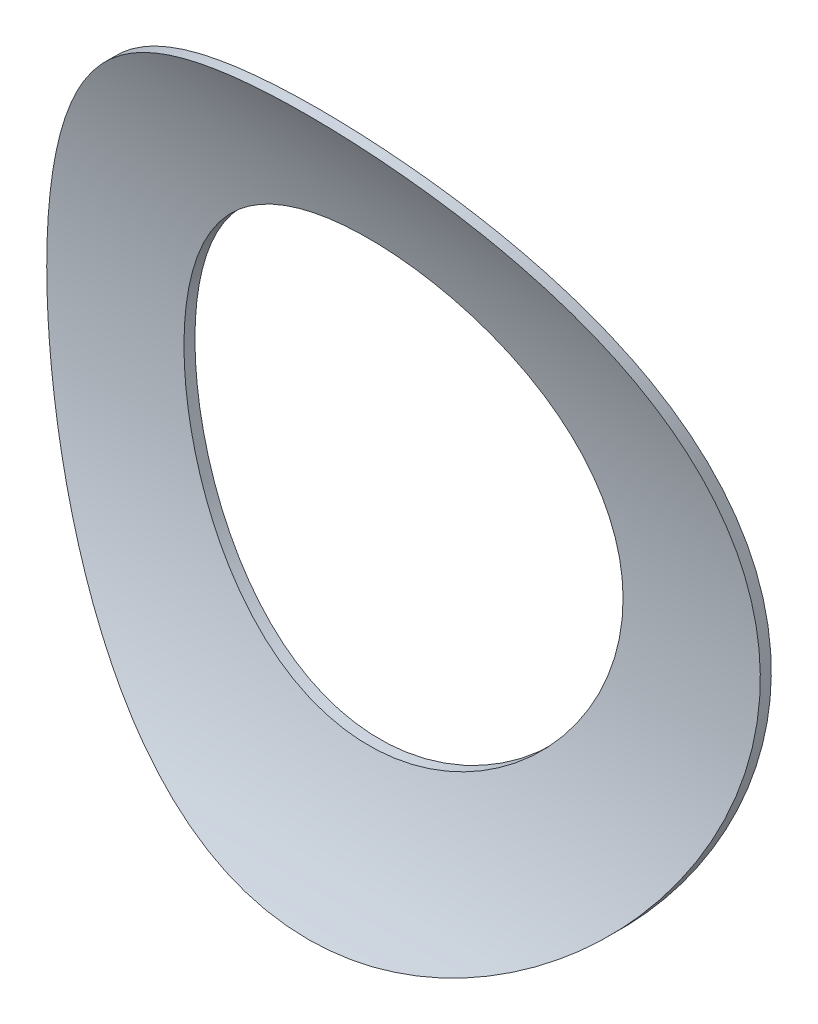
ISO-10303-21;
HEADER;
FILE_DESCRIPTION(('STEP AP214'),'2;1');
FILE_NAME('part.step','',(''),(''),'','','');
FILE_SCHEMA(('AUTOMOTIVE_DESIGN { 1 0 10303 214 1 1 1 1 }'));
ENDSEC;
DATA;
#1=APPLICATION_CONTEXT('core data for automotive mechanical design processes');
#2=APPLICATION_PROTOCOL_DEFINITION('international standard','automotive_design',2000,#1);
#3=PRODUCT_CONTEXT('',#1,'mechanical');
#4=PRODUCT('Part','Part','',(#3));
#5=PRODUCT_RELATED_PRODUCT_CATEGORY('part','',(#4));
#6=PRODUCT_DEFINITION_FORMATION('','',#4);
#7=PRODUCT_DEFINITION_CONTEXT('part definition',#1,'design');
#8=PRODUCT_DEFINITION('design','',#6,#7);
#9=PRODUCT_DEFINITION_SHAPE('','',#8);
#10=(LENGTH_UNIT() NAMED_UNIT(*) SI_UNIT(.MILLI.,.METRE.));
#11=(NAMED_UNIT(*) PLANE_ANGLE_UNIT() SI_UNIT($,.RADIAN.));
#12=(NAMED_UNIT(*) SI_UNIT($,.STERADIAN.) SOLID_ANGLE_UNIT());
#13=UNCERTAINTY_MEASURE_WITH_UNIT(LENGTH_MEASURE(1.E-05),#10,'distance_accuracy_value','');
#14=(GEOMETRIC_REPRESENTATION_CONTEXT(3) GLOBAL_UNCERTAINTY_ASSIGNED_CONTEXT((#13)) GLOBAL_UNIT_ASSIGNED_CONTEXT((#10,
#11,#12)) REPRESENTATION_CONTEXT('',''));
#15=CARTESIAN_POINT('',(0.,0.,0.));
#16=DIRECTION('',(0.,0.,1.));
#17=DIRECTION('',(1.,0.,0.));
#18=AXIS2_PLACEMENT_3D('',#15,#16,#17);
#19=CARTESIAN_POINT('',(0.,0.,2.));
#20=DIRECTION('',(0.,0.,-1.));
#21=DIRECTION('',(-1.,0.,0.));
#22=AXIS2_PLACEMENT_3D('',#19,#20,#21);
#23=CYLINDRICAL_SURFACE('',#22,6.49999999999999);
#24=CARTESIAN_POINT('',(-6.49999999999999,0.,0.199999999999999));
#25=CARTESIAN_POINT('',(-6.49999942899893,0.170935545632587,0.200000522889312));
#26=CARTESIAN_POINT('',(-6.49324938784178,0.34188305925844,0.203379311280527));
#27=CARTESIAN_POINT('',(-6.46632624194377,0.682518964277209,0.216809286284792));
#28=CARTESIAN_POINT('',(-6.44614729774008,0.852206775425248,0.22686337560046));
#29=CARTESIAN_POINT('',(-6.39256697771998,1.18921817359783,0.253403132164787));
#30=CARTESIAN_POINT('',(-6.35914674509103,1.35653803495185,0.269897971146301));
#31=CARTESIAN_POINT('',(-6.27945415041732,1.68743427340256,0.308904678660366));
#32=CARTESIAN_POINT('',(-6.23317653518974,1.85100909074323,0.331419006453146));
#33=CARTESIAN_POINT('',(-6.12848782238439,2.17257822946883,0.381799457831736));
#34=CARTESIAN_POINT('',(-6.07013026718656,2.33059369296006,0.409641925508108));
#35=CARTESIAN_POINT('',(-5.94171682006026,2.64087787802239,0.470082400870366));
#36=CARTESIAN_POINT('',(-5.87165654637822,2.79314442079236,0.502682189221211));
#37=CARTESIAN_POINT('',(-5.6448576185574,3.23989492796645,0.606499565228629));
#38=CARTESIAN_POINT('',(-5.47138435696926,3.5246838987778,0.683793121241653));
#39=CARTESIAN_POINT('',(-5.07312971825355,4.0788451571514,0.85284702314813));
#40=CARTESIAN_POINT('',(-4.84587922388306,4.34624244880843,0.94519968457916));
#41=CARTESIAN_POINT('',(-4.3515690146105,4.84108282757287,1.13211431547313));
#42=CARTESIAN_POINT('',(-4.08447924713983,5.06849546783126,1.22667790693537));
#43=CARTESIAN_POINT('',(-3.64698608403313,5.38379542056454,1.36659713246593));
#44=CARTESIAN_POINT('',(-3.48871264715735,5.48770198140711,1.41455606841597));
#45=CARTESIAN_POINT('',(-3.1629385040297,5.68169983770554,1.50684808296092));
#46=CARTESIAN_POINT('',(-2.99544168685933,5.77179689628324,1.5511826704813));
#47=CARTESIAN_POINT('',(-2.65215135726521,5.93737441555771,1.63469862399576));
#48=CARTESIAN_POINT('',(-2.47635839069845,6.01285583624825,1.67388032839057));
#49=CARTESIAN_POINT('',(-2.1176866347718,6.14834272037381,1.74557899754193));
#50=CARTESIAN_POINT('',(-1.93481210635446,6.20835732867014,1.77809989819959));
#51=CARTESIAN_POINT('',(-1.57435506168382,6.30906562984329,1.83343515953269));
#52=CARTESIAN_POINT('',(-1.39710588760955,6.3506970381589,1.85671220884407));
#53=CARTESIAN_POINT('',(-1.03888434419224,6.4190308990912,1.89524044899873));
#54=CARTESIAN_POINT('',(-0.857912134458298,6.445733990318,1.91049198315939));
#55=CARTESIAN_POINT('',(-0.493990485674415,6.48378105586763,1.9322998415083));
#56=CARTESIAN_POINT('',(-0.311042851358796,6.49513802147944,1.93886352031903));
#57=CARTESIAN_POINT('',(0.0552515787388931,6.50234522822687,1.94302312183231));
#58=CARTESIAN_POINT('',(0.23859833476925,6.49819694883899,1.94061990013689));
#59=CARTESIAN_POINT('',(0.58201337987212,6.47589551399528,1.92778158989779));
#60=CARTESIAN_POINT('',(0.74223588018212,6.45948196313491,1.91834452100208));
#61=CARTESIAN_POINT('',(1.06056511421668,6.41490767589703,1.89293945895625));
#62=CARTESIAN_POINT('',(1.21867113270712,6.38674306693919,1.87696931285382));
#63=CARTESIAN_POINT('',(1.53165723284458,6.31899161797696,1.83902076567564));
#64=CARTESIAN_POINT('',(1.68653773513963,6.27940627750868,1.81704315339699));
#65=CARTESIAN_POINT('',(1.99221278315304,6.18922615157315,1.7677600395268));
#66=CARTESIAN_POINT('',(2.14300569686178,6.13862703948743,1.74045244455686));
#67=CARTESIAN_POINT('',(2.59480893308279,5.96841259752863,1.65033157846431));
#68=CARTESIAN_POINT('',(2.88820136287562,5.83191421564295,1.58022570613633));
#69=CARTESIAN_POINT('',(3.44917315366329,5.51875468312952,1.42827337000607));
#70=CARTESIAN_POINT('',(3.71674084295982,5.34207549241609,1.34642163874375));
#71=CARTESIAN_POINT('',(4.25436508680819,4.92744748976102,1.16764907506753));
#72=CARTESIAN_POINT('',(4.52043541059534,4.684570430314,1.07013349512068));
#73=CARTESIAN_POINT('',(5.00981450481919,4.15705478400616,0.879392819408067));
#74=CARTESIAN_POINT('',(5.2331028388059,3.8723963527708,0.786169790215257));
#75=CARTESIAN_POINT('',(5.53597463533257,3.41159556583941,0.654550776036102));
#76=CARTESIAN_POINT('',(5.63336047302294,3.24831842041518,0.611183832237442));
#77=CARTESIAN_POINT('',(5.81387301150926,2.91291892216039,0.529379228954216));
#78=CARTESIAN_POINT('',(5.89700612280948,2.74080059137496,0.490939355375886));
#79=CARTESIAN_POINT('',(6.04811853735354,2.38891644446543,0.420121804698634));
#80=CARTESIAN_POINT('',(6.11610372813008,2.20915363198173,0.387741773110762));
#81=CARTESIAN_POINT('',(6.23613240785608,1.84328544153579,0.33001265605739));
#82=CARTESIAN_POINT('',(6.28817773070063,1.65718079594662,0.304662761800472));
#83=CARTESIAN_POINT('',(6.37199295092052,1.29584036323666,0.263575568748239));
#84=CARTESIAN_POINT('',(6.40508524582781,1.12098123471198,0.247215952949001));
#85=CARTESIAN_POINT('',(6.45684981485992,0.768628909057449,0.221540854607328));
#86=CARTESIAN_POINT('',(6.47552287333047,0.591135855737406,0.21222498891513));
#87=CARTESIAN_POINT('',(6.49819711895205,0.235053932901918,0.20090504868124));
#88=CARTESIAN_POINT('',(6.50220417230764,0.0564655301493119,0.198898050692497));
#89=CARTESIAN_POINT('',(6.49550772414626,-0.300361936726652,0.202245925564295));
#90=CARTESIAN_POINT('',(6.4848048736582,-0.478601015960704,0.207600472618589));
#91=CARTESIAN_POINT('',(6.45023801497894,-0.819419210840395,0.22481719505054));
#92=CARTESIAN_POINT('',(6.42746299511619,-0.982137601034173,0.236140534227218));
#93=CARTESIAN_POINT('',(6.3697736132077,-1.30494245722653,0.264645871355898));
#94=CARTESIAN_POINT('',(6.33485512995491,-1.46502801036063,0.281829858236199));
#95=CARTESIAN_POINT('',(6.25325800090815,-1.78141740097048,0.321647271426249));
#96=CARTESIAN_POINT('',(6.20658312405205,-1.93772243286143,0.344278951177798));
#97=CARTESIAN_POINT('',(6.10189865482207,-2.24573024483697,0.394491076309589));
#98=CARTESIAN_POINT('',(6.04388465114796,-2.39743120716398,0.422073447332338));
#99=CARTESIAN_POINT('',(5.9152433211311,-2.69955600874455,0.482422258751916));
#100=CARTESIAN_POINT('',(5.84430660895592,-2.84982337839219,0.515312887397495));
#101=CARTESIAN_POINT('',(5.69156235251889,-3.143817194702,0.584958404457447));
#102=CARTESIAN_POINT('',(5.60975112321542,-3.2875414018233,0.62171460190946));
#103=CARTESIAN_POINT('',(5.34888673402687,-3.70783928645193,0.736609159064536));
#104=CARTESIAN_POINT('',(5.1543351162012,-3.97369608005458,0.819406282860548));
#105=CARTESIAN_POINT('',(4.70749464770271,-4.49656686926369,0.998988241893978));
#106=CARTESIAN_POINT('',(4.45141208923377,-4.75014872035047,1.09634823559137));
#107=CARTESIAN_POINT('',(4.03828101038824,-5.096536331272,1.24002325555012));
#108=CARTESIAN_POINT('',(3.89562288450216,-5.20640153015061,1.28755414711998));
#109=CARTESIAN_POINT('',(3.60117018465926,-5.41424316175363,1.38057053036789));
#110=CARTESIAN_POINT('',(3.44937424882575,-5.51221781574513,1.42605571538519));
#111=CARTESIAN_POINT('',(3.1297980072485,-5.70003311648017,1.51578035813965));
#112=CARTESIAN_POINT('',(2.96159915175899,-5.78924342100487,1.55985067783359));
#113=CARTESIAN_POINT('',(2.6170222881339,-5.95294474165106,1.64271374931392));
#114=CARTESIAN_POINT('',(2.44064827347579,-6.02744285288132,1.68150904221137));
#115=CARTESIAN_POINT('',(2.08094258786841,-6.16088008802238,1.75232488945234));
#116=CARTESIAN_POINT('',(1.89761663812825,-6.21983170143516,1.78435087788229));
#117=CARTESIAN_POINT('',(1.5253009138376,-6.32144556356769,1.84030357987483));
#118=CARTESIAN_POINT('',(1.33631202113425,-6.36411033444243,1.8642315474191));
#119=CARTESIAN_POINT('',(0.972708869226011,-6.42919916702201,1.90103304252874));
#120=CARTESIAN_POINT('',(0.79845621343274,-6.45317305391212,1.91474723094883));
#121=CARTESIAN_POINT('',(0.448135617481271,-6.48692002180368,1.934111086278));
#122=CARTESIAN_POINT('',(0.272067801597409,-6.49669406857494,1.9397613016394));
#123=CARTESIAN_POINT('',(-0.0802839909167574,-6.50189119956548,1.94276146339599));
#124=CARTESIAN_POINT('',(-0.256567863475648,-6.49731959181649,1.9401144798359));
#125=CARTESIAN_POINT('',(-0.607861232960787,-6.4739086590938,1.92663813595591));
#126=CARTESIAN_POINT('',(-0.782870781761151,-6.45506991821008,1.91580911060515));
#127=CARTESIAN_POINT('',(-1.11352645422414,-6.40587714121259,1.88781838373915));
#128=CARTESIAN_POINT('',(-1.26942371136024,-6.37679671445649,1.87136137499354));
#129=CARTESIAN_POINT('',(-1.57801611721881,-6.30752772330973,1.83264969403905));
#130=CARTESIAN_POINT('',(-1.73071018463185,-6.26733547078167,1.81039309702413));
#131=CARTESIAN_POINT('',(-2.1825918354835,-6.13067466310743,1.7358951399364));
#132=CARTESIAN_POINT('',(-2.47579064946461,-6.0180899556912,1.67590626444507));
#133=CARTESIAN_POINT('',(-3.05911087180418,-5.74478915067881,1.53714151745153));
#134=CARTESIAN_POINT('',(-3.34770206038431,-5.58134752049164,1.45737421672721));
#135=CARTESIAN_POINT('',(-3.89526377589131,-5.21399619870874,1.28970727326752));
#136=CARTESIAN_POINT('',(-4.15421878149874,-5.01006545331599,1.2018034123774));
#137=CARTESIAN_POINT('',(-4.6679604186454,-4.53826965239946,1.01493631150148));
#138=CARTESIAN_POINT('',(-4.9184173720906,-4.26564695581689,0.915927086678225));
#139=CARTESIAN_POINT('',(-5.25763611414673,-3.82643877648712,0.774936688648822));
#140=CARTESIAN_POINT('',(-5.36470599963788,-3.67484992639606,0.729158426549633));
#141=CARTESIAN_POINT('',(-5.56589900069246,-3.36232808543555,0.641296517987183));
#142=CARTESIAN_POINT('',(-5.66002801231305,-3.20139939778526,0.599211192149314));
#143=CARTESIAN_POINT('',(-5.83519137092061,-2.86983882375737,0.51956913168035));
#144=CARTESIAN_POINT('',(-5.91611965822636,-2.69914193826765,0.482049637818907));
#145=CARTESIAN_POINT('',(-6.06312454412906,-2.35038361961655,0.413003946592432));
#146=CARTESIAN_POINT('',(-6.12920843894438,-2.17232585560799,0.381474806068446));
#147=CARTESIAN_POINT('',(-6.24564705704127,-1.81050625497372,0.32539287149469));
#148=CARTESIAN_POINT('',(-6.29603608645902,-1.62675783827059,0.300824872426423));
#149=CARTESIAN_POINT('',(-6.38057940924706,-1.25480764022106,0.259349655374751));
#150=CARTESIAN_POINT('',(-6.41474361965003,-1.06660865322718,0.242437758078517));
#151=CARTESIAN_POINT('',(-6.46031679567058,-0.731954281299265,0.219807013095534));
#152=CARTESIAN_POINT('',(-6.4751852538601,-0.586073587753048,0.212392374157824));
#153=CARTESIAN_POINT('',(-6.4950272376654,-0.29346488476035,0.202488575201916));
#154=CARTESIAN_POINT('',(-6.50000049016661,-0.146736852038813,0.199999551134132));
#155=CARTESIAN_POINT('',(-6.49999999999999,0.,0.199999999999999));
#156=B_SPLINE_CURVE_WITH_KNOTS('',3,(#24,#25,#26,#27,#28,#29,#30,#31,#32,#33,#34,#35,#36,#37,
#38,#39,#40,#41,#42,#43,#44,#45,#46,#47,#48,#49,#50,#51,#52,#53,#54,#55,#56,#57,#58,#59,#60,#61,
#62,#63,#64,#65,#66,#67,#68,#69,#70,#71,#72,#73,#74,#75,#76,#77,#78,#79,#80,#81,#82,#83,#84,#85,
#86,#87,#88,#89,#90,#91,#92,#93,#94,#95,#96,#97,#98,#99,#100,#101,#102,#103,#104,#105,#106,#107,
#108,#109,#110,#111,#112,#113,#114,#115,#116,#117,#118,#119,#120,#121,#122,#123,#124,#125,#126,
#127,#128,#129,#130,#131,#132,#133,#134,#135,#136,#137,#138,#139,#140,#141,#142,#143,#144,#145,
#146,#147,#148,#149,#150,#151,#152,#153,#154,#155),.UNSPECIFIED.,.T.,.F.,(4,2,2,2,2,2,2,2,2,2,2,
2,2,2,2,2,2,2,2,2,2,2,2,2,2,2,2,2,2,2,2,2,2,2,2,2,2,2,2,2,2,2,2,2,2,2,2,2,2,2,2,2,2,2,2,2,2,2,2,
2,2,2,2,2,2,4),(0.,0.512661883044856,1.02554683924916,1.53916483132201,2.05299298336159,
2.56459065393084,3.07638030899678,4.09884074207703,5.18315772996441,6.26829684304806,
6.85362104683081,7.43870030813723,8.02374112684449,8.60843523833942,9.15831182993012,
9.70816489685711,10.2575521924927,10.8068870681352,11.2903279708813,11.7739283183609,
12.2574651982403,12.7411923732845,13.7301957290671,14.7196440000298,15.8345513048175,
16.94998986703,17.5343280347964,18.1184026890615,18.7022499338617,19.2860299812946,
19.8214526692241,20.3568462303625,20.8920256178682,21.4271813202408,21.9206922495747,
22.414370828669,22.9078913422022,23.4016042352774,23.9092305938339,24.417029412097,
25.4321080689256,26.5468684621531,27.1050533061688,27.6633215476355,28.2488358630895,
28.8340671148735,29.4188267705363,30.0034958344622,30.532040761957,31.0605497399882,
31.5888631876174,32.1171550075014,32.5949221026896,33.0728479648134,34.0280618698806,
35.0474521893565,36.0673739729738,37.211223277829,37.7841135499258,38.3567419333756,
38.9337657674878,39.5105053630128,40.0859753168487,40.6610930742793,41.1011672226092,
41.5412535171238),.UNSPECIFIED.);
#157=CARTESIAN_POINT('',(-6.49999999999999,0.,0.199999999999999));
#158=VERTEX_POINT('',#157);
#159=EDGE_CURVE('E37',#158,#158,#156,.T.);
#160=ORIENTED_EDGE('',*,*,#159,.T.);
#161=EDGE_LOOP('',(#160));
#162=FACE_BOUND('',#161,.T.);
#163=CARTESIAN_POINT('',(-6.49999999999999,0.,0.));
#164=CARTESIAN_POINT('',(-6.49999942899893,-0.170935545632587,5.22889315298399E-07));
#165=CARTESIAN_POINT('',(-6.49324938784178,-0.34188305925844,0.00337931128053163));
#166=CARTESIAN_POINT('',(-6.46632624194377,-0.682518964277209,0.0168092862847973));
#167=CARTESIAN_POINT('',(-6.44614729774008,-0.852206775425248,0.0268633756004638));
#168=CARTESIAN_POINT('',(-6.39256697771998,-1.18921817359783,0.0534031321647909));
#169=CARTESIAN_POINT('',(-6.35914674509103,-1.35653803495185,0.0698979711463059));
#170=CARTESIAN_POINT('',(-6.27945415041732,-1.68743427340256,0.108904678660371));
#171=CARTESIAN_POINT('',(-6.23317653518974,-1.85100909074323,0.131419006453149));
#172=CARTESIAN_POINT('',(-6.12848782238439,-2.17257822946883,0.181799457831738));
#173=CARTESIAN_POINT('',(-6.07013026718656,-2.33059369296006,0.20964192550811));
#174=CARTESIAN_POINT('',(-5.94171682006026,-2.64087787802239,0.270082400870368));
#175=CARTESIAN_POINT('',(-5.87165654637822,-2.79314442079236,0.302682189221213));
#176=CARTESIAN_POINT('',(-5.6448576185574,-3.23989492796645,0.406499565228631));
#177=CARTESIAN_POINT('',(-5.47138435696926,-3.5246838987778,0.483793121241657));
#178=CARTESIAN_POINT('',(-5.07312971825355,-4.0788451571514,0.652847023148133));
#179=CARTESIAN_POINT('',(-4.84587922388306,-4.34624244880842,0.745199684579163));
#180=CARTESIAN_POINT('',(-4.3515690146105,-4.84108282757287,0.932114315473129));
#181=CARTESIAN_POINT('',(-4.08447924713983,-5.06849546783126,1.02667790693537));
#182=CARTESIAN_POINT('',(-3.64698608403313,-5.38379542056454,1.16659713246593));
#183=CARTESIAN_POINT('',(-3.48871264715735,-5.48770198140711,1.21455606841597));
#184=CARTESIAN_POINT('',(-3.1629385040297,-5.68169983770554,1.30684808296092));
#185=CARTESIAN_POINT('',(-2.99544168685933,-5.77179689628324,1.3511826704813));
#186=CARTESIAN_POINT('',(-2.65215135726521,-5.93737441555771,1.43469862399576));
#187=CARTESIAN_POINT('',(-2.47635839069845,-6.01285583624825,1.47388032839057));
#188=CARTESIAN_POINT('',(-2.1176866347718,-6.14834272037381,1.54557899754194));
#189=CARTESIAN_POINT('',(-1.93481210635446,-6.20835732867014,1.57809989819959));
#190=CARTESIAN_POINT('',(-1.57435506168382,-6.30906562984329,1.63343515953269));
#191=CARTESIAN_POINT('',(-1.39710588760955,-6.3506970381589,1.65671220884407));
#192=CARTESIAN_POINT('',(-1.03888434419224,-6.41903089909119,1.69524044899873));
#193=CARTESIAN_POINT('',(-0.857912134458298,-6.445733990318,1.71049198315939));
#194=CARTESIAN_POINT('',(-0.493990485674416,-6.48378105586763,1.7322998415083));
#195=CARTESIAN_POINT('',(-0.311042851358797,-6.49513802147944,1.73886352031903));
#196=CARTESIAN_POINT('',(0.0552515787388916,-6.50234522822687,1.74302312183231));
#197=CARTESIAN_POINT('',(0.238598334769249,-6.49819694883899,1.74061990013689));
#198=CARTESIAN_POINT('',(0.58201337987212,-6.47589551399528,1.7277815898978));
#199=CARTESIAN_POINT('',(0.742235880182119,-6.45948196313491,1.71834452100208));
#200=CARTESIAN_POINT('',(1.06056511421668,-6.41490767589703,1.69293945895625));
#201=CARTESIAN_POINT('',(1.21867113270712,-6.38674306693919,1.67696931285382));
#202=CARTESIAN_POINT('',(1.53165723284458,-6.31899161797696,1.63902076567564));
#203=CARTESIAN_POINT('',(1.68653773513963,-6.27940627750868,1.61704315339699));
#204=CARTESIAN_POINT('',(1.99221278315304,-6.18922615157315,1.5677600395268));
#205=CARTESIAN_POINT('',(2.14300569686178,-6.13862703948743,1.54045244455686));
#206=CARTESIAN_POINT('',(2.59480893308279,-5.96841259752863,1.45033157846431));
#207=CARTESIAN_POINT('',(2.88820136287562,-5.83191421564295,1.38022570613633));
#208=CARTESIAN_POINT('',(3.44917315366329,-5.51875468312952,1.22827337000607));
#209=CARTESIAN_POINT('',(3.71674084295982,-5.34207549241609,1.14642163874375));
#210=CARTESIAN_POINT('',(4.25436508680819,-4.92744748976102,0.967649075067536));
#211=CARTESIAN_POINT('',(4.52043541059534,-4.68457043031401,0.870133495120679));
#212=CARTESIAN_POINT('',(5.00981450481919,-4.15705478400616,0.679392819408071));
#213=CARTESIAN_POINT('',(5.23310283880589,-3.8723963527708,0.586169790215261));
#214=CARTESIAN_POINT('',(5.53597463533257,-3.41159556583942,0.454550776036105));
#215=CARTESIAN_POINT('',(5.63336047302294,-3.24831842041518,0.411183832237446));
#216=CARTESIAN_POINT('',(5.81387301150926,-2.91291892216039,0.329379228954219));
#217=CARTESIAN_POINT('',(5.89700612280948,-2.74080059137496,0.29093935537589));
#218=CARTESIAN_POINT('',(6.04811853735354,-2.38891644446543,0.220121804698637));
#219=CARTESIAN_POINT('',(6.11610372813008,-2.20915363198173,0.187741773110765));
#220=CARTESIAN_POINT('',(6.23613240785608,-1.8432854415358,0.130012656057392));
#221=CARTESIAN_POINT('',(6.28817773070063,-1.65718079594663,0.104662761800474));
#222=CARTESIAN_POINT('',(6.37199295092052,-1.29584036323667,0.0635755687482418));
#223=CARTESIAN_POINT('',(6.40508524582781,-1.12098123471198,0.0472159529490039));
#224=CARTESIAN_POINT('',(6.45684981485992,-0.768628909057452,0.0215408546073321));
#225=CARTESIAN_POINT('',(6.47552287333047,-0.59113585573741,0.0122249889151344));
#226=CARTESIAN_POINT('',(6.49819711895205,-0.235053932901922,0.000905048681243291));
#227=CARTESIAN_POINT('',(6.50220417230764,-0.0564655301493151,-0.00110194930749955));
#228=CARTESIAN_POINT('',(6.49550772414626,0.300361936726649,0.00224592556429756));
#229=CARTESIAN_POINT('',(6.4848048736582,0.478601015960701,0.00760047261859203));
#230=CARTESIAN_POINT('',(6.45023801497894,0.819419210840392,0.0248171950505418));
#231=CARTESIAN_POINT('',(6.42746299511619,0.98213760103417,0.0361405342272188));
#232=CARTESIAN_POINT('',(6.3697736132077,1.30494245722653,0.0646458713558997));
#233=CARTESIAN_POINT('',(6.33485512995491,1.46502801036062,0.0818298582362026));
#234=CARTESIAN_POINT('',(6.25325800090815,1.78141740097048,0.121647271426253));
#235=CARTESIAN_POINT('',(6.20658312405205,1.93772243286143,0.144278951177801));
#236=CARTESIAN_POINT('',(6.10189865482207,2.24573024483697,0.194491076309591));
#237=CARTESIAN_POINT('',(6.04388465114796,2.39743120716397,0.22207344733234));
#238=CARTESIAN_POINT('',(5.9152433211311,2.69955600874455,0.282422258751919));
#239=CARTESIAN_POINT('',(5.84430660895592,2.84982337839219,0.315312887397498));
#240=CARTESIAN_POINT('',(5.6915623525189,3.143817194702,0.38495840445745));
#241=CARTESIAN_POINT('',(5.60975112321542,3.28754140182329,0.421714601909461));
#242=CARTESIAN_POINT('',(5.34888673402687,3.70783928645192,0.536609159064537));
#243=CARTESIAN_POINT('',(5.1543351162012,3.97369608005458,0.619406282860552));
#244=CARTESIAN_POINT('',(4.70749464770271,4.49656686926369,0.798988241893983));
#245=CARTESIAN_POINT('',(4.45141208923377,4.75014872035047,0.896348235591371));
#246=CARTESIAN_POINT('',(4.03828101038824,5.096536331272,1.04002325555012));
#247=CARTESIAN_POINT('',(3.89562288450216,5.20640153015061,1.08755414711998));
#248=CARTESIAN_POINT('',(3.60117018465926,5.41424316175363,1.1805705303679));
#249=CARTESIAN_POINT('',(3.44937424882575,5.51221781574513,1.22605571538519));
#250=CARTESIAN_POINT('',(3.1297980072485,5.70003311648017,1.31578035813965));
#251=CARTESIAN_POINT('',(2.96159915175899,5.78924342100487,1.3598506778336));
#252=CARTESIAN_POINT('',(2.6170222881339,5.95294474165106,1.44271374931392));
#253=CARTESIAN_POINT('',(2.44064827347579,6.02744285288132,1.48150904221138));
#254=CARTESIAN_POINT('',(2.08094258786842,6.16088008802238,1.55232488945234));
#255=CARTESIAN_POINT('',(1.89761663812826,6.21983170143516,1.5843508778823));
#256=CARTESIAN_POINT('',(1.5253009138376,6.32144556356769,1.64030357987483));
#257=CARTESIAN_POINT('',(1.33631202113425,6.36411033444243,1.66423154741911));
#258=CARTESIAN_POINT('',(0.972708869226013,6.42919916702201,1.70103304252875));
#259=CARTESIAN_POINT('',(0.798456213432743,6.45317305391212,1.71474723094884));
#260=CARTESIAN_POINT('',(0.448135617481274,6.48692002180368,1.73411108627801));
#261=CARTESIAN_POINT('',(0.272067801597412,6.49669406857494,1.7397613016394));
#262=CARTESIAN_POINT('',(-0.0802839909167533,6.50189119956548,1.742761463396));
#263=CARTESIAN_POINT('',(-0.256567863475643,6.49731959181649,1.74011447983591));
#264=CARTESIAN_POINT('',(-0.607861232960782,6.4739086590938,1.72663813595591));
#265=CARTESIAN_POINT('',(-0.782870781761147,6.45506991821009,1.71580911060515));
#266=CARTESIAN_POINT('',(-1.11352645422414,6.40587714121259,1.68781838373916));
#267=CARTESIAN_POINT('',(-1.26942371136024,6.37679671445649,1.67136137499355));
#268=CARTESIAN_POINT('',(-1.57801611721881,6.30752772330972,1.63264969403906));
#269=CARTESIAN_POINT('',(-1.73071018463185,6.26733547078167,1.61039309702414));
#270=CARTESIAN_POINT('',(-2.1825918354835,6.13067466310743,1.53589513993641));
#271=CARTESIAN_POINT('',(-2.47579064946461,6.0180899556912,1.47590626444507));
#272=CARTESIAN_POINT('',(-3.05911087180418,5.74478915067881,1.33714151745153));
#273=CARTESIAN_POINT('',(-3.3477020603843,5.58134752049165,1.25737421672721));
#274=CARTESIAN_POINT('',(-3.8952637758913,5.21399619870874,1.08970727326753));
#275=CARTESIAN_POINT('',(-4.15421878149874,5.01006545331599,1.0018034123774));
#276=CARTESIAN_POINT('',(-4.6679604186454,4.53826965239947,0.814936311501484));
#277=CARTESIAN_POINT('',(-4.9184173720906,4.26564695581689,0.715927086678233));
#278=CARTESIAN_POINT('',(-5.25763611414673,3.82643877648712,0.574936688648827));
#279=CARTESIAN_POINT('',(-5.36470599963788,3.67484992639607,0.529158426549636));
#280=CARTESIAN_POINT('',(-5.56589900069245,3.36232808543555,0.441296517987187));
#281=CARTESIAN_POINT('',(-5.66002801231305,3.20139939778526,0.399211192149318));
#282=CARTESIAN_POINT('',(-5.8351913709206,2.86983882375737,0.319569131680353));
#283=CARTESIAN_POINT('',(-5.91611965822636,2.69914193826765,0.282049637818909));
#284=CARTESIAN_POINT('',(-6.06312454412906,2.35038361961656,0.213003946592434));
#285=CARTESIAN_POINT('',(-6.12920843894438,2.17232585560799,0.181474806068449));
#286=CARTESIAN_POINT('',(-6.24564705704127,1.81050625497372,0.125392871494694));
#287=CARTESIAN_POINT('',(-6.29603608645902,1.6267578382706,0.100824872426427));
#288=CARTESIAN_POINT('',(-6.38057940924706,1.25480764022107,0.0593496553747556));
#289=CARTESIAN_POINT('',(-6.41474361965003,1.06660865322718,0.0424377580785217));
#290=CARTESIAN_POINT('',(-6.46031679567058,0.731954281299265,0.0198070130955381));
#291=CARTESIAN_POINT('',(-6.4751852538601,0.586073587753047,0.0123923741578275));
#292=CARTESIAN_POINT('',(-6.4950272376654,0.293464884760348,0.00248857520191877));
#293=CARTESIAN_POINT('',(-6.50000049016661,0.146736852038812,-4.48865864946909E-07));
#294=CARTESIAN_POINT('',(-6.49999999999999,0.,0.));
#295=B_SPLINE_CURVE_WITH_KNOTS('',3,(#163,#164,#165,#166,#167,#168,#169,#170,#171,#172,#173,
#174,#175,#176,#177,#178,#179,#180,#181,#182,#183,#184,#185,#186,#187,#188,#189,#190,#191,#192,
#193,#194,#195,#196,#197,#198,#199,#200,#201,#202,#203,#204,#205,#206,#207,#208,#209,#210,#211,
#212,#213,#214,#215,#216,#217,#218,#219,#220,#221,#222,#223,#224,#225,#226,#227,#228,#229,#230,
#231,#232,#233,#234,#235,#236,#237,#238,#239,#240,#241,#242,#243,#244,#245,#246,#247,#248,#249,
#250,#251,#252,#253,#254,#255,#256,#257,#258,#259,#260,#261,#262,#263,#264,#265,#266,#267,#268,
#269,#270,#271,#272,#273,#274,#275,#276,#277,#278,#279,#280,#281,#282,#283,#284,#285,#286,#287,
#288,#289,#290,#291,#292,#293,#294),.UNSPECIFIED.,.T.,.F.,(4,2,2,2,2,2,2,2,2,2,2,2,2,2,2,2,2,2,
2,2,2,2,2,2,2,2,2,2,2,2,2,2,2,2,2,2,2,2,2,2,2,2,2,2,2,2,2,2,2,2,2,2,2,2,2,2,2,2,2,2,2,2,2,2,2,
4),(0.,0.512661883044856,1.02554683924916,1.53916483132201,2.05299298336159,2.56459065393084,
3.07638030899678,4.09884074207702,5.18315772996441,6.26829684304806,6.85362104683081,
7.43870030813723,8.02374112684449,8.60843523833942,9.15831182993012,9.70816489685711,
10.2575521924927,10.8068870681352,11.2903279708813,11.7739283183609,12.2574651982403,
12.7411923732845,13.7301957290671,14.7196440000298,15.8345513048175,16.94998986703,
17.5343280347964,18.1184026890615,18.7022499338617,19.2860299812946,19.8214526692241,
20.3568462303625,20.8920256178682,21.4271813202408,21.9206922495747,22.414370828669,
22.9078913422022,23.4016042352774,23.9092305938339,24.417029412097,25.4321080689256,
26.5468684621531,27.1050533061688,27.6633215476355,28.2488358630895,28.8340671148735,
29.4188267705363,30.0034958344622,30.532040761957,31.0605497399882,31.5888631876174,
32.1171550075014,32.5949221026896,33.0728479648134,34.0280618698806,35.0474521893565,
36.0673739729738,37.211223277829,37.7841135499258,38.3567419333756,38.9337657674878,
39.5105053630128,40.0859753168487,40.6610930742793,41.1011672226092,41.5412535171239),.UNSPECIFIED.);
#296=CARTESIAN_POINT('',(-6.49999999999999,0.,0.));
#297=VERTEX_POINT('',#296);
#298=EDGE_CURVE('E46',#297,#297,#295,.T.);
#299=ORIENTED_EDGE('',*,*,#298,.T.);
#300=EDGE_LOOP('',(#299));
#301=FACE_BOUND('',#300,.T.);
#302=ADVANCED_FACE('F27',(#162,#301),#23,.T.);
#303=CARTESIAN_POINT('',(0.,0.,2.));
#304=DIRECTION('',(0.,0.,-1.));
#305=DIRECTION('',(-1.,0.,0.));
#306=AXIS2_PLACEMENT_3D('',#303,#304,#305);
#307=CYLINDRICAL_SURFACE('',#306,3.99999999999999);
#308=CARTESIAN_POINT('',(-3.99999999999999,0.,0.));
#309=CARTESIAN_POINT('',(-3.99999807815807,-0.219172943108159,1.41625128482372E-06));
#310=CARTESIAN_POINT('',(-3.98192670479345,-0.438365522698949,0.00559528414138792));
#311=CARTESIAN_POINT('',(-3.91030117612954,-0.870351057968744,0.0273628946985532));
#312=CARTESIAN_POINT('',(-3.85673800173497,-1.08314237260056,0.0435393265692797));
#313=CARTESIAN_POINT('',(-3.71609858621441,-1.4960330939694,0.0847028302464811));
#314=CARTESIAN_POINT('',(-3.62907327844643,-1.69615125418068,0.10967650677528));
#315=CARTESIAN_POINT('',(-3.42419358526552,-2.07895491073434,0.165849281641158));
#316=CARTESIAN_POINT('',(-3.30633463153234,-2.26163781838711,0.197049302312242));
#317=CARTESIAN_POINT('',(-3.03940464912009,-2.60987398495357,0.263404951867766));
#318=CARTESIAN_POINT('',(-2.88957516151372,-2.77482977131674,0.298644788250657));
#319=CARTESIAN_POINT('',(-2.5645727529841,-3.07771416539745,0.368614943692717));
#320=CARTESIAN_POINT('',(-2.38939530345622,-3.21563793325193,0.403345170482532));
#321=CARTESIAN_POINT('',(-2.01354279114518,-3.46374552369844,0.469262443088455));
#322=CARTESIAN_POINT('',(-1.81235942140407,-3.57318962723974,0.500345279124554));
#323=CARTESIAN_POINT('',(-1.39333207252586,-3.75644488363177,0.554185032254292));
#324=CARTESIAN_POINT('',(-1.1754923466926,-3.83026509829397,0.57694406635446));
#325=CARTESIAN_POINT('',(-0.736065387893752,-3.93800321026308,0.610679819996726));
#326=CARTESIAN_POINT('',(-0.514774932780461,-3.9730267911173,0.621982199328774));
#327=CARTESIAN_POINT('',(-0.0691925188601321,-4.00563111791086,0.632492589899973));
#328=CARTESIAN_POINT('',(0.155098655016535,-4.00322147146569,0.631703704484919));
#329=CARTESIAN_POINT('',(0.591230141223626,-3.96189396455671,0.618408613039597));
#330=CARTESIAN_POINT('',(0.803218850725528,-3.92437369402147,0.606350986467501));
#331=CARTESIAN_POINT('',(1.21773339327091,-3.81615290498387,0.572604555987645));
#332=CARTESIAN_POINT('',(1.42025824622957,-3.74544895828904,0.550914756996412));
#333=CARTESIAN_POINT('',(1.81346009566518,-3.57186443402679,0.499998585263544));
#334=CARTESIAN_POINT('',(2.00392697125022,-3.46853941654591,0.470669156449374));
#335=CARTESIAN_POINT('',(2.36528108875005,-3.23295451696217,0.407826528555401));
#336=CARTESIAN_POINT('',(2.53616335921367,-3.10068731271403,0.374312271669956));
#337=CARTESIAN_POINT('',(2.8614087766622,-2.80408228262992,0.305068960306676));
#338=CARTESIAN_POINT('',(3.01471256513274,-2.63858832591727,0.269307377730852));
#339=CARTESIAN_POINT('',(3.29164440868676,-2.28379541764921,0.200903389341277));
#340=CARTESIAN_POINT('',(3.41527039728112,-2.09449480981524,0.168261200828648));
#341=CARTESIAN_POINT('',(3.63002595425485,-1.69546584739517,0.10944886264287));
#342=CARTESIAN_POINT('',(3.72090972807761,-1.48559743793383,0.0833281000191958));
#343=CARTESIAN_POINT('',(3.86577250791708,-1.05256186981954,0.0408579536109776));
#344=CARTESIAN_POINT('',(3.91976236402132,-0.829398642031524,0.0245056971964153));
#345=CARTESIAN_POINT('',(3.98751609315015,-0.385105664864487,0.00387419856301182));
#346=CARTESIAN_POINT('',(4.00271470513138,-0.164214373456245,-0.00083544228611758));
#347=CARTESIAN_POINT('',(3.99649046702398,0.276982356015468,0.00107999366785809));
#348=CARTESIAN_POINT('',(3.97507278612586,0.497287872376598,0.00770347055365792));
#349=CARTESIAN_POINT('',(3.89737903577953,0.92557160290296,0.0312585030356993));
#350=CARTESIAN_POINT('',(3.84195070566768,1.13371871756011,0.0479392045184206));
#351=CARTESIAN_POINT('',(3.69883784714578,1.53770562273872,0.0896654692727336));
#352=CARTESIAN_POINT('',(3.61114937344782,1.73354390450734,0.114712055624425));
#353=CARTESIAN_POINT('',(3.40365761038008,2.11255922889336,0.171332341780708));
#354=CARTESIAN_POINT('',(3.28313664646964,2.29532163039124,0.203047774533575));
#355=CARTESIAN_POINT('',(3.01426633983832,2.63851213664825,0.269373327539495));
#356=CARTESIAN_POINT('',(2.86590967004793,2.79893434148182,0.303984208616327));
#357=CARTESIAN_POINT('',(2.53883340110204,3.09927056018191,0.373867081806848));
#358=CARTESIAN_POINT('',(2.35916784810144,3.2381626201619,0.409113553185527));
#359=CARTESIAN_POINT('',(1.97831333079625,3.48390975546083,0.474880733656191));
#360=CARTESIAN_POINT('',(1.7771248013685,3.59076547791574,0.505401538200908));
#361=CARTESIAN_POINT('',(1.35944348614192,3.76871415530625,0.557917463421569));
#362=CARTESIAN_POINT('',(1.14301946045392,3.83995734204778,0.579948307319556));
#363=CARTESIAN_POINT('',(0.700434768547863,3.94475052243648,0.612828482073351));
#364=CARTESIAN_POINT('',(0.474277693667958,3.97831429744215,0.623681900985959));
#365=CARTESIAN_POINT('',(0.0293038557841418,4.00582647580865,0.632561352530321));
#366=CARTESIAN_POINT('',(-0.189400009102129,4.00144721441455,0.631128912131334));
#367=CARTESIAN_POINT('',(-0.622795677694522,3.95721713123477,0.616908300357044));
#368=CARTESIAN_POINT('',(-0.837487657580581,3.91736787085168,0.604120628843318));
#369=CARTESIAN_POINT('',(-1.253874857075,3.80443315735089,0.569002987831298));
#370=CARTESIAN_POINT('',(-1.45570821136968,3.73181232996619,0.546806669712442));
#371=CARTESIAN_POINT('',(-1.84448711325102,3.55576002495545,0.495403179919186));
#372=CARTESIAN_POINT('',(-2.03142969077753,3.45232242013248,0.466194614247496));
#373=CARTESIAN_POINT('',(-2.39282501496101,3.21296345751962,0.402669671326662));
#374=CARTESIAN_POINT('',(-2.56653098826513,3.07595504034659,0.368201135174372));
#375=CARTESIAN_POINT('',(-2.88902813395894,2.77527343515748,0.298754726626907));
#376=CARTESIAN_POINT('',(-3.03781270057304,2.61159320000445,0.263776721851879));
#377=CARTESIAN_POINT('',(-3.31089835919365,2.25604634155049,0.195939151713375));
#378=CARTESIAN_POINT('',(-3.43428715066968,2.0634577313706,0.163180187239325));
#379=CARTESIAN_POINT('',(-3.64676891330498,1.65926238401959,0.104712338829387));
#380=CARTESIAN_POINT('',(-3.73587637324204,1.44766372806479,0.079000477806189));
#381=CARTESIAN_POINT('',(-3.87020142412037,1.03185930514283,0.0394930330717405));
#382=CARTESIAN_POINT('',(-3.91873894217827,0.828806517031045,0.024809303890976));
#383=CARTESIAN_POINT('',(-3.98363611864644,0.417174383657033,0.00506301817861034));
#384=CARTESIAN_POINT('',(-4.00000182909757,0.208596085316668,-1.34790576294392E-06));
#385=CARTESIAN_POINT('',(-3.99999999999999,0.,0.));
#386=B_SPLINE_CURVE_WITH_KNOTS('',3,(#308,#309,#310,#311,#312,#313,#314,#315,#316,#317,#318,
#319,#320,#321,#322,#323,#324,#325,#326,#327,#328,#329,#330,#331,#332,#333,#334,#335,#336,#337,
#338,#339,#340,#341,#342,#343,#344,#345,#346,#347,#348,#349,#350,#351,#352,#353,#354,#355,#356,
#357,#358,#359,#360,#361,#362,#363,#364,#365,#366,#367,#368,#369,#370,#371,#372,#373,#374,#375,
#376,#377,#378,#379,#380,#381,#382,#383,#384,#385),.UNSPECIFIED.,.T.,.F.,(4,2,2,2,2,2,2,2,2,2,2,
2,2,2,2,2,2,2,2,2,2,2,2,2,2,2,2,2,2,2,2,2,2,2,2,2,2,2,4),(0.,0.656752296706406,1.31367154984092,
1.96959482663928,2.62561534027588,3.29939203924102,3.97328926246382,4.66325239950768,
5.35303993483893,6.02261825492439,6.69202472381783,7.33586971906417,7.97978124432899,
8.63287449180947,9.2861331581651,9.96817015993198,10.6502546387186,11.337357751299,
12.0242587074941,12.6853593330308,13.3463666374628,13.9915318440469,14.6367759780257,
15.2974465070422,15.9582911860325,16.644469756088,17.3306344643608,18.0138796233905,
18.6968748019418,19.3499255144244,20.0029474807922,20.6469886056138,21.2911578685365,
21.9598589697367,22.628737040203,23.3185550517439,24.008081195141,24.6332575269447,
25.2583162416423),.UNSPECIFIED.);
#387=CARTESIAN_POINT('',(-3.99999999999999,0.,0.));
#388=VERTEX_POINT('',#387);
#389=EDGE_CURVE('E10',#388,#388,#386,.T.);
#390=ORIENTED_EDGE('',*,*,#389,.F.);
#391=EDGE_LOOP('',(#390));
#392=FACE_BOUND('',#391,.T.);
#393=CARTESIAN_POINT('',(-3.99999999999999,0.,0.199999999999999));
#394=CARTESIAN_POINT('',(-3.99999807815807,0.219172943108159,0.200001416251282));
#395=CARTESIAN_POINT('',(-3.98192670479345,0.438365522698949,0.205595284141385));
#396=CARTESIAN_POINT('',(-3.91030117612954,0.870351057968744,0.22736289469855));
#397=CARTESIAN_POINT('',(-3.85673800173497,1.08314237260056,0.243539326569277));
#398=CARTESIAN_POINT('',(-3.71609858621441,1.4960330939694,0.284702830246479));
#399=CARTESIAN_POINT('',(-3.62907327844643,1.69615125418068,0.309676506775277));
#400=CARTESIAN_POINT('',(-3.42419358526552,2.07895491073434,0.365849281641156));
#401=CARTESIAN_POINT('',(-3.30633463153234,2.26163781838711,0.39704930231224));
#402=CARTESIAN_POINT('',(-3.03940464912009,2.60987398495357,0.463404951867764));
#403=CARTESIAN_POINT('',(-2.88957516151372,2.77482977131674,0.498644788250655));
#404=CARTESIAN_POINT('',(-2.5645727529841,3.07771416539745,0.568614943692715));
#405=CARTESIAN_POINT('',(-2.38939530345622,3.21563793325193,0.60334517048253));
#406=CARTESIAN_POINT('',(-2.01354279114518,3.46374552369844,0.669262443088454));
#407=CARTESIAN_POINT('',(-1.81235942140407,3.57318962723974,0.700345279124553));
#408=CARTESIAN_POINT('',(-1.39333207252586,3.75644488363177,0.754185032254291));
#409=CARTESIAN_POINT('',(-1.1754923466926,3.83026509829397,0.776944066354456));
#410=CARTESIAN_POINT('',(-0.736065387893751,3.93800321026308,0.810679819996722));
#411=CARTESIAN_POINT('',(-0.514774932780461,3.9730267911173,0.821982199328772));
#412=CARTESIAN_POINT('',(-0.0691925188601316,4.00563111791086,0.832492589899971));
#413=CARTESIAN_POINT('',(0.155098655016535,4.00322147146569,0.831703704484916));
#414=CARTESIAN_POINT('',(0.591230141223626,3.96189396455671,0.818408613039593));
#415=CARTESIAN_POINT('',(0.803218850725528,3.92437369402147,0.806350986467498));
#416=CARTESIAN_POINT('',(1.21773339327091,3.81615290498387,0.772604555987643));
#417=CARTESIAN_POINT('',(1.42025824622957,3.74544895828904,0.75091475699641));
#418=CARTESIAN_POINT('',(1.81346009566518,3.57186443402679,0.699998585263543));
#419=CARTESIAN_POINT('',(2.00392697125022,3.46853941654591,0.670669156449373));
#420=CARTESIAN_POINT('',(2.36528108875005,3.23295451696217,0.607826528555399));
#421=CARTESIAN_POINT('',(2.53616335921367,3.10068731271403,0.574312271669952));
#422=CARTESIAN_POINT('',(2.8614087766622,2.80408228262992,0.505068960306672));
#423=CARTESIAN_POINT('',(3.01471256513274,2.63858832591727,0.469307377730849));
#424=CARTESIAN_POINT('',(3.29164440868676,2.28379541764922,0.400903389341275));
#425=CARTESIAN_POINT('',(3.41527039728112,2.09449480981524,0.368261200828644));
#426=CARTESIAN_POINT('',(3.63002595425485,1.69546584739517,0.309448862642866));
#427=CARTESIAN_POINT('',(3.72090972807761,1.48559743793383,0.283328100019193));
#428=CARTESIAN_POINT('',(3.86577250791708,1.05256186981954,0.240857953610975));
#429=CARTESIAN_POINT('',(3.91976236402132,0.829398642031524,0.224505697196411));
#430=CARTESIAN_POINT('',(3.98751609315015,0.385105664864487,0.203874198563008));
#431=CARTESIAN_POINT('',(4.00271470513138,0.164214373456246,0.19916455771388));
#432=CARTESIAN_POINT('',(3.99649046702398,-0.276982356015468,0.201079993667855));
#433=CARTESIAN_POINT('',(3.97507278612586,-0.497287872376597,0.207703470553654));
#434=CARTESIAN_POINT('',(3.89737903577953,-0.925571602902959,0.231258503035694));
#435=CARTESIAN_POINT('',(3.84195070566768,-1.13371871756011,0.247939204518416));
#436=CARTESIAN_POINT('',(3.69883784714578,-1.53770562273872,0.28966546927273));
#437=CARTESIAN_POINT('',(3.61114937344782,-1.73354390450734,0.314712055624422));
#438=CARTESIAN_POINT('',(3.40365761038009,-2.11255922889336,0.371332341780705));
#439=CARTESIAN_POINT('',(3.28313664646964,-2.29532163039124,0.40304777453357));
#440=CARTESIAN_POINT('',(3.01426633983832,-2.63851213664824,0.46937332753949));
#441=CARTESIAN_POINT('',(2.86590967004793,-2.79893434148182,0.503984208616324));
#442=CARTESIAN_POINT('',(2.53883340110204,-3.09927056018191,0.573867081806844));
#443=CARTESIAN_POINT('',(2.35916784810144,-3.2381626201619,0.609113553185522));
#444=CARTESIAN_POINT('',(1.97831333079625,-3.48390975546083,0.674880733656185));
#445=CARTESIAN_POINT('',(1.7771248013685,-3.59076547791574,0.705401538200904));
#446=CARTESIAN_POINT('',(1.35944348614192,-3.76871415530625,0.757917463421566));
#447=CARTESIAN_POINT('',(1.14301946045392,-3.83995734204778,0.779948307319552));
#448=CARTESIAN_POINT('',(0.700434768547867,-3.94475052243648,0.812828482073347));
#449=CARTESIAN_POINT('',(0.47427769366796,-3.97831429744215,0.823681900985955));
#450=CARTESIAN_POINT('',(0.0293038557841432,-4.00582647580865,0.832561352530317));
#451=CARTESIAN_POINT('',(-0.189400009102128,-4.00144721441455,0.83112891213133));
#452=CARTESIAN_POINT('',(-0.62279567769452,-3.95721713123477,0.81690830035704));
#453=CARTESIAN_POINT('',(-0.83748765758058,-3.91736787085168,0.804120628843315));
#454=CARTESIAN_POINT('',(-1.253874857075,-3.80443315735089,0.769002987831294));
#455=CARTESIAN_POINT('',(-1.45570821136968,-3.73181232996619,0.746806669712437));
#456=CARTESIAN_POINT('',(-1.84448711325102,-3.55576002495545,0.695403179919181));
#457=CARTESIAN_POINT('',(-2.03142969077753,-3.45232242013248,0.666194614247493));
#458=CARTESIAN_POINT('',(-2.39282501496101,-3.21296345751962,0.602669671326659));
#459=CARTESIAN_POINT('',(-2.56653098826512,-3.07595504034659,0.568201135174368));
#460=CARTESIAN_POINT('',(-2.88902813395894,-2.77527343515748,0.498754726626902));
#461=CARTESIAN_POINT('',(-3.03781270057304,-2.61159320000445,0.463776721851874));
#462=CARTESIAN_POINT('',(-3.31089835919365,-2.25604634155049,0.395939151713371));
#463=CARTESIAN_POINT('',(-3.43428715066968,-2.0634577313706,0.36318018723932));
#464=CARTESIAN_POINT('',(-3.64676891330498,-1.65926238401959,0.304712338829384));
#465=CARTESIAN_POINT('',(-3.73587637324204,-1.44766372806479,0.279000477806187));
#466=CARTESIAN_POINT('',(-3.87020142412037,-1.03185930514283,0.239493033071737));
#467=CARTESIAN_POINT('',(-3.91873894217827,-0.828806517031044,0.224809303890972));
#468=CARTESIAN_POINT('',(-3.98363611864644,-0.417174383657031,0.205063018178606));
#469=CARTESIAN_POINT('',(-4.00000182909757,-0.208596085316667,0.199998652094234));
#470=CARTESIAN_POINT('',(-3.99999999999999,0.,0.199999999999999));
#471=B_SPLINE_CURVE_WITH_KNOTS('',3,(#393,#394,#395,#396,#397,#398,#399,#400,#401,#402,#403,
#404,#405,#406,#407,#408,#409,#410,#411,#412,#413,#414,#415,#416,#417,#418,#419,#420,#421,#422,
#423,#424,#425,#426,#427,#428,#429,#430,#431,#432,#433,#434,#435,#436,#437,#438,#439,#440,#441,
#442,#443,#444,#445,#446,#447,#448,#449,#450,#451,#452,#453,#454,#455,#456,#457,#458,#459,#460,
#461,#462,#463,#464,#465,#466,#467,#468,#469,#470),.UNSPECIFIED.,.T.,.F.,(4,2,2,2,2,2,2,2,2,2,2,
2,2,2,2,2,2,2,2,2,2,2,2,2,2,2,2,2,2,2,2,2,2,2,2,2,2,2,4),(0.,0.656752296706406,1.31367154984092,
1.96959482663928,2.62561534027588,3.29939203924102,3.97328926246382,4.66325239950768,
5.35303993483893,6.02261825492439,6.69202472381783,7.33586971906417,7.97978124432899,
8.63287449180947,9.2861331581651,9.96817015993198,10.6502546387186,11.337357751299,
12.0242587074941,12.6853593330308,13.3463666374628,13.9915318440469,14.6367759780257,
15.2974465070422,15.9582911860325,16.644469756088,17.3306344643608,18.0138796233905,
18.6968748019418,19.3499255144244,20.0029474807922,20.6469886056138,21.2911578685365,
21.9598589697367,22.628737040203,23.3185550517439,24.008081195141,24.6332575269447,
25.2583162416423),.UNSPECIFIED.);
#472=CARTESIAN_POINT('',(-3.99999999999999,0.,0.199999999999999));
#473=VERTEX_POINT('',#472);
#474=EDGE_CURVE('E41',#473,#473,#471,.T.);
#475=ORIENTED_EDGE('',*,*,#474,.F.);
#476=EDGE_LOOP('',(#475));
#477=FACE_BOUND('',#476,.T.);
#478=ADVANCED_FACE('F59',(#392,#477),#307,.F.);
#479=CARTESIAN_POINT('',(-6.49999999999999,0.,13.2));
#480=DIRECTION('',(1.,0.,0.));
#481=DIRECTION('',(0.,0.,-1.));
#482=AXIS2_PLACEMENT_3D('',#479,#480,#481);
#483=CYLINDRICAL_SURFACE('',#482,13.);
#484=ORIENTED_EDGE('',*,*,#474,.T.);
#485=EDGE_LOOP('',(#484));
#486=FACE_BOUND('',#485,.T.);
#487=ORIENTED_EDGE('',*,*,#159,.F.);
#488=EDGE_LOOP('',(#487));
#489=FACE_BOUND('',#488,.T.);
#490=ADVANCED_FACE('F55',(#486,#489),#483,.F.);
#491=CARTESIAN_POINT('',(-6.49999999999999,0.,13.));
#492=DIRECTION('',(1.,0.,0.));
#493=DIRECTION('',(0.,0.,-1.));
#494=AXIS2_PLACEMENT_3D('',#491,#492,#493);
#495=CYLINDRICAL_SURFACE('',#494,13.);
#496=ORIENTED_EDGE('',*,*,#389,.T.);
#497=EDGE_LOOP('',(#496));
#498=FACE_BOUND('',#497,.T.);
#499=ORIENTED_EDGE('',*,*,#298,.F.);
#500=EDGE_LOOP('',(#499));
#501=FACE_BOUND('',#500,.T.);
#502=ADVANCED_FACE('F58',(#498,#501),#495,.T.);
#503=CLOSED_SHELL('',(#302,#478,#490,#502));
#504=MANIFOLD_SOLID_BREP('B2',#503);
#505=ADVANCED_BREP_SHAPE_REPRESENTATION('',(#18,#504),#14);
#506=SHAPE_DEFINITION_REPRESENTATION(#9,#505);
ENDSEC;
END-ISO-10303-21;
